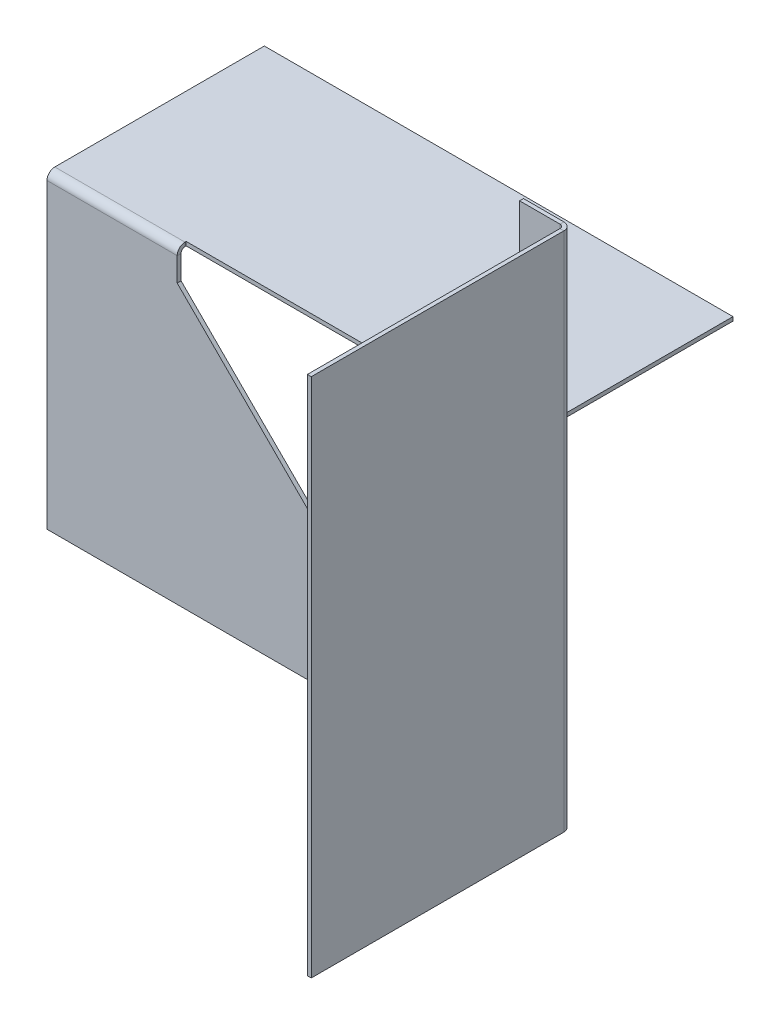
ISO-10303-21;
HEADER;
FILE_DESCRIPTION(('STEP AP214'),'2;1');
FILE_NAME('part.step','',(''),(''),'','','');
FILE_SCHEMA(('AUTOMOTIVE_DESIGN { 1 0 10303 214 1 1 1 1 }'));
ENDSEC;
DATA;
#1=APPLICATION_CONTEXT('core data for automotive mechanical design processes');
#2=APPLICATION_PROTOCOL_DEFINITION('international standard','automotive_design',2000,#1);
#3=PRODUCT_CONTEXT('',#1,'mechanical');
#4=PRODUCT('Part','Part','',(#3));
#5=PRODUCT_RELATED_PRODUCT_CATEGORY('part','',(#4));
#6=PRODUCT_DEFINITION_FORMATION('','',#4);
#7=PRODUCT_DEFINITION_CONTEXT('part definition',#1,'design');
#8=PRODUCT_DEFINITION('design','',#6,#7);
#9=PRODUCT_DEFINITION_SHAPE('','',#8);
#10=(LENGTH_UNIT() NAMED_UNIT(*) SI_UNIT(.MILLI.,.METRE.));
#11=(NAMED_UNIT(*) PLANE_ANGLE_UNIT() SI_UNIT($,.RADIAN.));
#12=(NAMED_UNIT(*) SI_UNIT($,.STERADIAN.) SOLID_ANGLE_UNIT());
#13=UNCERTAINTY_MEASURE_WITH_UNIT(LENGTH_MEASURE(1.E-05),#10,'distance_accuracy_value','');
#14=(GEOMETRIC_REPRESENTATION_CONTEXT(3) GLOBAL_UNCERTAINTY_ASSIGNED_CONTEXT((#13)) GLOBAL_UNIT_ASSIGNED_CONTEXT((#10,
#11,#12)) REPRESENTATION_CONTEXT('',''));
#15=CARTESIAN_POINT('',(0.,0.,0.));
#16=DIRECTION('',(0.,0.,1.));
#17=DIRECTION('',(1.,0.,0.));
#18=AXIS2_PLACEMENT_3D('',#15,#16,#17);
#19=CARTESIAN_POINT('',(-200.,200.,1.50000000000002));
#20=DIRECTION('',(-1.,0.,0.));
#21=DIRECTION('',(0.,0.,1.));
#22=AXIS2_PLACEMENT_3D('',#19,#20,#21);
#23=PLANE('',#22);
#24=DIRECTION('',(0.,-1.,0.));
#25=VECTOR('',#24,1.);
#26=CARTESIAN_POINT('',(-200.,200.,1.50000000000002));
#27=LINE('',#26,#25);
#28=CARTESIAN_POINT('',(-200.,116.,1.50000000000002));
#29=VERTEX_POINT('',#28);
#30=CARTESIAN_POINT('',(-200.,0.,1.50000000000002));
#31=VERTEX_POINT('',#30);
#32=EDGE_CURVE('E576',#29,#31,#27,.T.);
#33=ORIENTED_EDGE('',*,*,#32,.F.);
#34=DIRECTION('',(0.,0.,-1.));
#35=VECTOR('',#34,1.);
#36=CARTESIAN_POINT('',(-200.,116.,1.50000000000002));
#37=LINE('',#36,#35);
#38=CARTESIAN_POINT('',(-200.,116.,0.));
#39=VERTEX_POINT('',#38);
#40=EDGE_CURVE('E668',#29,#39,#37,.T.);
#41=ORIENTED_EDGE('',*,*,#40,.T.);
#42=DIRECTION('',(0.,-1.,0.));
#43=VECTOR('',#42,1.);
#44=CARTESIAN_POINT('',(-200.,200.,0.));
#45=LINE('',#44,#43);
#46=CARTESIAN_POINT('',(-200.,0.,0.));
#47=VERTEX_POINT('',#46);
#48=EDGE_CURVE('E581',#39,#47,#45,.T.);
#49=ORIENTED_EDGE('',*,*,#48,.T.);
#50=DIRECTION('',(0.,0.,-1.));
#51=VECTOR('',#50,1.);
#52=CARTESIAN_POINT('',(-200.,0.,1.50000000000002));
#53=LINE('',#52,#51);
#54=EDGE_CURVE('E546',#31,#47,#53,.T.);
#55=ORIENTED_EDGE('',*,*,#54,.F.);
#56=EDGE_LOOP('',(#33,#41,#49,#55));
#57=FACE_BOUND('',#56,.T.);
#58=ADVANCED_FACE('F45',(#57),#23,.T.);
#59=CARTESIAN_POINT('',(0.,200.,0.));
#60=DIRECTION('',(0.,0.,-1.));
#61=DIRECTION('',(-1.,0.,0.));
#62=AXIS2_PLACEMENT_3D('',#59,#60,#61);
#63=PLANE('',#62);
#64=ORIENTED_EDGE('',*,*,#48,.F.);
#65=DIRECTION('',(1.,0.,0.));
#66=VECTOR('',#65,1.);
#67=CARTESIAN_POINT('',(0.,116.,0.));
#68=LINE('',#67,#66);
#69=CARTESIAN_POINT('',(-150.,116.,4.05996130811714E-08));
#70=VERTEX_POINT('',#69);
#71=EDGE_CURVE('E601',#39,#70,#68,.T.);
#72=ORIENTED_EDGE('',*,*,#71,.T.);
#73=DIRECTION('',(0.,-1.,0.));
#74=VECTOR('',#73,1.);
#75=CARTESIAN_POINT('',(-150.,106.87867965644,0.));
#76=LINE('',#75,#74);
#77=CARTESIAN_POINT('',(-150.,106.87867965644,0.));
#78=VERTEX_POINT('',#77);
#79=EDGE_CURVE('E531',#70,#78,#76,.T.);
#80=ORIENTED_EDGE('',*,*,#79,.T.);
#81=DIRECTION('',(0.707106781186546,-0.707106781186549,0.));
#82=VECTOR('',#81,1.);
#83=CARTESIAN_POINT('',(-150.,106.87867965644,0.));
#84=LINE('',#83,#82);
#85=CARTESIAN_POINT('',(-70.,26.87867965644,0.));
#86=VERTEX_POINT('',#85);
#87=EDGE_CURVE('E512',#78,#86,#84,.T.);
#88=ORIENTED_EDGE('',*,*,#87,.T.);
#89=DIRECTION('',(0.,1.,0.));
#90=VECTOR('',#89,1.);
#91=CARTESIAN_POINT('',(-70.,28.9999999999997,0.));
#92=LINE('',#91,#90);
#93=CARTESIAN_POINT('',(-70.,28.9999999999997,0.));
#94=VERTEX_POINT('',#93);
#95=EDGE_CURVE('E515',#86,#94,#92,.T.);
#96=ORIENTED_EDGE('',*,*,#95,.T.);
#97=DIRECTION('',(-0.707106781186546,0.707106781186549,0.));
#98=VECTOR('',#97,1.);
#99=CARTESIAN_POINT('',(-148.5,107.5,0.));
#100=LINE('',#99,#98);
#101=CARTESIAN_POINT('',(-71.4657082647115,30.4657082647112,0.));
#102=VERTEX_POINT('',#101);
#103=EDGE_CURVE('E519',#94,#102,#100,.T.);
#104=ORIENTED_EDGE('',*,*,#103,.T.);
#105=DIRECTION('',(0.,1.,0.));
#106=VECTOR('',#105,1.);
#107=CARTESIAN_POINT('',(-71.4657082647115,200.,0.));
#108=LINE('',#107,#106);
#109=CARTESIAN_POINT('',(-71.4657082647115,115.,5.00255078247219E-08));
#110=VERTEX_POINT('',#109);
#111=EDGE_CURVE('E597',#102,#110,#108,.T.);
#112=ORIENTED_EDGE('',*,*,#111,.T.);
#113=DIRECTION('',(1.,0.,0.));
#114=VECTOR('',#113,1.);
#115=CARTESIAN_POINT('',(-76.,115.,0.));
#116=LINE('',#115,#114);
#117=CARTESIAN_POINT('',(-70.,115.,0.));
#118=VERTEX_POINT('',#117);
#119=EDGE_CURVE('E605',#110,#118,#116,.T.);
#120=ORIENTED_EDGE('',*,*,#119,.T.);
#121=DIRECTION('',(0.,1.,0.));
#122=VECTOR('',#121,1.);
#123=CARTESIAN_POINT('',(-70.,115.,0.));
#124=LINE('',#123,#122);
#125=CARTESIAN_POINT('',(-70.,116.,0.));
#126=VERTEX_POINT('',#125);
#127=EDGE_CURVE('E607',#118,#126,#124,.T.);
#128=ORIENTED_EDGE('',*,*,#127,.T.);
#129=DIRECTION('',(1.,0.,0.));
#130=VECTOR('',#129,1.);
#131=CARTESIAN_POINT('',(0.,116.,0.));
#132=LINE('',#131,#130);
#133=CARTESIAN_POINT('',(-20.,116.,4.05995972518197E-08));
#134=VERTEX_POINT('',#133);
#135=EDGE_CURVE('E701',#126,#134,#132,.T.);
#136=ORIENTED_EDGE('',*,*,#135,.T.);
#137=DIRECTION('',(0.,-1.,0.));
#138=VECTOR('',#137,1.);
#139=CARTESIAN_POINT('',(-20.,200.,0.));
#140=LINE('',#139,#138);
#141=CARTESIAN_POINT('',(-20.,115.5,0.));
#142=VERTEX_POINT('',#141);
#143=EDGE_CURVE('E494',#134,#142,#140,.T.);
#144=ORIENTED_EDGE('',*,*,#143,.T.);
#145=DIRECTION('',(1.,0.,0.));
#146=VECTOR('',#145,1.);
#147=CARTESIAN_POINT('',(-18.5,115.5,0.));
#148=LINE('',#147,#146);
#149=CARTESIAN_POINT('',(-18.5,115.5,0.));
#150=VERTEX_POINT('',#149);
#151=EDGE_CURVE('E495',#142,#150,#148,.T.);
#152=ORIENTED_EDGE('',*,*,#151,.T.);
#153=DIRECTION('',(0.,1.,0.));
#154=VECTOR('',#153,1.);
#155=CARTESIAN_POINT('',(-18.5,200.,0.));
#156=LINE('',#155,#154);
#157=CARTESIAN_POINT('',(-18.5,200.,0.));
#158=VERTEX_POINT('',#157);
#159=EDGE_CURVE('E491',#150,#158,#156,.T.);
#160=ORIENTED_EDGE('',*,*,#159,.T.);
#161=DIRECTION('',(1.,0.,0.));
#162=VECTOR('',#161,1.);
#163=CARTESIAN_POINT('',(0.,200.,0.));
#164=LINE('',#163,#162);
#165=CARTESIAN_POINT('',(-3.,200.,0.));
#166=VERTEX_POINT('',#165);
#167=EDGE_CURVE('E566',#158,#166,#164,.T.);
#168=ORIENTED_EDGE('',*,*,#167,.T.);
#169=DIRECTION('',(0.,-1.,0.));
#170=VECTOR('',#169,1.);
#171=CARTESIAN_POINT('',(-3.,200.,0.));
#172=LINE('',#171,#170);
#173=CARTESIAN_POINT('',(-3.,0.,0.));
#174=VERTEX_POINT('',#173);
#175=EDGE_CURVE('E577',#166,#174,#172,.T.);
#176=ORIENTED_EDGE('',*,*,#175,.T.);
#177=DIRECTION('',(1.,0.,0.));
#178=VECTOR('',#177,1.);
#179=CARTESIAN_POINT('',(0.,0.,0.));
#180=LINE('',#179,#178);
#181=EDGE_CURVE('E543',#47,#174,#180,.T.);
#182=ORIENTED_EDGE('',*,*,#181,.F.);
#183=EDGE_LOOP('',(#64,#72,#80,#88,#96,#104,#112,#120,#128,#136,#144,#152,#160,#168,#176,#182));
#184=FACE_BOUND('',#183,.T.);
#185=ADVANCED_FACE('F644',(#184),#63,.T.);
#186=CARTESIAN_POINT('',(-3.,200.,3.));
#187=DIRECTION('',(0.,1.,0.));
#188=DIRECTION('',(0.,0.,1.));
#189=AXIS2_PLACEMENT_3D('',#186,#187,#188);
#190=PLANE('',#189);
#191=DIRECTION('',(0.,0.,1.));
#192=VECTOR('',#191,1.);
#193=CARTESIAN_POINT('',(-18.5,200.,0.));
#194=LINE('',#193,#192);
#195=CARTESIAN_POINT('',(-18.5,200.,1.5));
#196=VERTEX_POINT('',#195);
#197=EDGE_CURVE('E498',#158,#196,#194,.T.);
#198=ORIENTED_EDGE('',*,*,#197,.T.);
#199=DIRECTION('',(1.,0.,0.));
#200=VECTOR('',#199,1.);
#201=CARTESIAN_POINT('',(0.,200.,1.5));
#202=LINE('',#201,#200);
#203=CARTESIAN_POINT('',(-3.,200.,1.5));
#204=VERTEX_POINT('',#203);
#205=EDGE_CURVE('E49',#196,#204,#202,.T.);
#206=ORIENTED_EDGE('',*,*,#205,.T.);
#207=DIRECTION('',(0.,0.,-1.));
#208=VECTOR('',#207,1.);
#209=CARTESIAN_POINT('',(-3.,200.,1.5));
#210=LINE('',#209,#208);
#211=EDGE_CURVE('E592',#204,#166,#210,.T.);
#212=ORIENTED_EDGE('',*,*,#211,.T.);
#213=ORIENTED_EDGE('',*,*,#167,.F.);
#214=EDGE_LOOP('',(#198,#206,#212,#213));
#215=FACE_BOUND('',#214,.T.);
#216=ADVANCED_FACE('F641',(#215),#190,.T.);
#217=CARTESIAN_POINT('',(0.,200.,3.));
#218=DIRECTION('',(0.,1.,0.));
#219=DIRECTION('',(0.,0.,1.));
#220=AXIS2_PLACEMENT_3D('',#217,#218,#219);
#221=PLANE('',#220);
#222=DIRECTION('',(-1.,0.,0.));
#223=VECTOR('',#222,1.);
#224=CARTESIAN_POINT('',(0.,200.,3.));
#225=LINE('',#224,#223);
#226=CARTESIAN_POINT('',(0.,200.,3.));
#227=VERTEX_POINT('',#226);
#228=CARTESIAN_POINT('',(-1.5,200.,3.));
#229=VERTEX_POINT('',#228);
#230=EDGE_CURVE('E595',#227,#229,#225,.T.);
#231=ORIENTED_EDGE('',*,*,#230,.F.);
#232=CARTESIAN_POINT('',(-3.,200.,3.));
#233=DIRECTION('',(0.,1.,0.));
#234=DIRECTION('',(0.,0.,1.));
#235=AXIS2_PLACEMENT_3D('',#232,#233,#234);
#236=CIRCLE('',#235,3.);
#237=EDGE_CURVE('E563',#166,#227,#236,.F.);
#238=ORIENTED_EDGE('',*,*,#237,.F.);
#239=ORIENTED_EDGE('',*,*,#211,.F.);
#240=CARTESIAN_POINT('',(-3.,200.,3.));
#241=DIRECTION('',(0.,1.,0.));
#242=DIRECTION('',(1.,0.,0.));
#243=AXIS2_PLACEMENT_3D('',#240,#241,#242);
#244=CIRCLE('',#243,1.5);
#245=EDGE_CURVE('E567',#204,#229,#244,.F.);
#246=ORIENTED_EDGE('',*,*,#245,.T.);
#247=EDGE_LOOP('',(#231,#238,#239,#246));
#248=FACE_BOUND('',#247,.T.);
#249=ADVANCED_FACE('F635',(#248),#221,.T.);
#250=CARTESIAN_POINT('',(-3.,200.,1.5));
#251=DIRECTION('',(0.,1.,0.));
#252=DIRECTION('',(0.,0.,1.));
#253=AXIS2_PLACEMENT_3D('',#250,#251,#252);
#254=PLANE('',#253);
#255=DIRECTION('',(0.,0.,1.));
#256=VECTOR('',#255,1.);
#257=CARTESIAN_POINT('',(0.,200.,0.));
#258=LINE('',#257,#256);
#259=CARTESIAN_POINT('',(0.,200.,100.));
#260=VERTEX_POINT('',#259);
#261=EDGE_CURVE('E560',#227,#260,#258,.T.);
#262=ORIENTED_EDGE('',*,*,#261,.F.);
#263=ORIENTED_EDGE('',*,*,#230,.T.);
#264=DIRECTION('',(0.,0.,1.));
#265=VECTOR('',#264,1.);
#266=CARTESIAN_POINT('',(-1.5,200.,0.));
#267=LINE('',#266,#265);
#268=CARTESIAN_POINT('',(-1.49999999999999,200.,100.));
#269=VERTEX_POINT('',#268);
#270=EDGE_CURVE('E555',#229,#269,#267,.T.);
#271=ORIENTED_EDGE('',*,*,#270,.T.);
#272=DIRECTION('',(-1.,0.,0.));
#273=VECTOR('',#272,1.);
#274=CARTESIAN_POINT('',(0.,200.,100.));
#275=LINE('',#274,#273);
#276=EDGE_CURVE('E557',#260,#269,#275,.T.);
#277=ORIENTED_EDGE('',*,*,#276,.F.);
#278=EDGE_LOOP('',(#262,#263,#271,#277));
#279=FACE_BOUND('',#278,.T.);
#280=ADVANCED_FACE('F735',(#279),#254,.T.);
#281=CARTESIAN_POINT('',(-3.,0.,0.));
#282=DIRECTION('',(0.,-1.,0.));
#283=DIRECTION('',(0.,0.,-1.));
#284=AXIS2_PLACEMENT_3D('',#281,#282,#283);
#285=PLANE('',#284);
#286=DIRECTION('',(0.,0.,1.));
#287=VECTOR('',#286,1.);
#288=CARTESIAN_POINT('',(-3.,0.,0.));
#289=LINE('',#288,#287);
#290=CARTESIAN_POINT('',(-3.,0.,1.5));
#291=VERTEX_POINT('',#290);
#292=EDGE_CURVE('E590',#174,#291,#289,.T.);
#293=ORIENTED_EDGE('',*,*,#292,.F.);
#294=CARTESIAN_POINT('',(-3.,0.,3.));
#295=DIRECTION('',(0.,1.,0.));
#296=DIRECTION('',(0.,0.,1.));
#297=AXIS2_PLACEMENT_3D('',#294,#295,#296);
#298=CIRCLE('',#297,3.);
#299=CARTESIAN_POINT('',(0.,0.,3.));
#300=VERTEX_POINT('',#299);
#301=EDGE_CURVE('E540',#174,#300,#298,.F.);
#302=ORIENTED_EDGE('',*,*,#301,.T.);
#303=DIRECTION('',(1.,0.,0.));
#304=VECTOR('',#303,1.);
#305=CARTESIAN_POINT('',(-1.5,0.,3.));
#306=LINE('',#305,#304);
#307=CARTESIAN_POINT('',(-1.5,0.,3.));
#308=VERTEX_POINT('',#307);
#309=EDGE_CURVE('E588',#308,#300,#306,.T.);
#310=ORIENTED_EDGE('',*,*,#309,.F.);
#311=CARTESIAN_POINT('',(-3.,0.,3.));
#312=DIRECTION('',(0.,1.,0.));
#313=DIRECTION('',(1.,0.,0.));
#314=AXIS2_PLACEMENT_3D('',#311,#312,#313);
#315=CIRCLE('',#314,1.5);
#316=EDGE_CURVE('E552',#291,#308,#315,.F.);
#317=ORIENTED_EDGE('',*,*,#316,.F.);
#318=EDGE_LOOP('',(#293,#302,#310,#317));
#319=FACE_BOUND('',#318,.T.);
#320=ADVANCED_FACE('F746',(#319),#285,.T.);
#321=CARTESIAN_POINT('',(-1.5,0.,3.));
#322=DIRECTION('',(0.,-1.,0.));
#323=DIRECTION('',(0.,0.,-1.));
#324=AXIS2_PLACEMENT_3D('',#321,#322,#323);
#325=PLANE('',#324);
#326=ORIENTED_EDGE('',*,*,#181,.T.);
#327=ORIENTED_EDGE('',*,*,#292,.T.);
#328=DIRECTION('',(1.,0.,0.));
#329=VECTOR('',#328,1.);
#330=CARTESIAN_POINT('',(0.,0.,1.5));
#331=LINE('',#330,#329);
#332=EDGE_CURVE('E549',#31,#291,#331,.T.);
#333=ORIENTED_EDGE('',*,*,#332,.F.);
#334=ORIENTED_EDGE('',*,*,#54,.T.);
#335=EDGE_LOOP('',(#326,#327,#333,#334));
#336=FACE_BOUND('',#335,.T.);
#337=ADVANCED_FACE('F744',(#336),#325,.T.);
#338=CARTESIAN_POINT('',(-1.5,200.,0.));
#339=DIRECTION('',(1.,0.,0.));
#340=DIRECTION('',(0.,0.,-1.));
#341=AXIS2_PLACEMENT_3D('',#338,#339,#340);
#342=PLANE('',#341);
#343=DIRECTION('',(0.,0.,1.));
#344=VECTOR('',#343,1.);
#345=CARTESIAN_POINT('',(-1.5,0.,0.));
#346=LINE('',#345,#344);
#347=CARTESIAN_POINT('',(-1.49999999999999,0.,100.));
#348=VERTEX_POINT('',#347);
#349=EDGE_CURVE('E523',#308,#348,#346,.T.);
#350=ORIENTED_EDGE('',*,*,#349,.T.);
#351=DIRECTION('',(0.,-1.,0.));
#352=VECTOR('',#351,1.);
#353=CARTESIAN_POINT('',(-1.49999999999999,200.,100.));
#354=LINE('',#353,#352);
#355=EDGE_CURVE('E586',#269,#348,#354,.T.);
#356=ORIENTED_EDGE('',*,*,#355,.F.);
#357=ORIENTED_EDGE('',*,*,#270,.F.);
#358=DIRECTION('',(0.,-1.,0.));
#359=VECTOR('',#358,1.);
#360=CARTESIAN_POINT('',(-1.5,200.,3.));
#361=LINE('',#360,#359);
#362=EDGE_CURVE('E570',#229,#308,#361,.T.);
#363=ORIENTED_EDGE('',*,*,#362,.T.);
#364=EDGE_LOOP('',(#350,#356,#357,#363));
#365=FACE_BOUND('',#364,.T.);
#366=ADVANCED_FACE('F731',(#365),#342,.F.);
#367=CARTESIAN_POINT('',(0.,200.,100.));
#368=DIRECTION('',(0.,0.,1.));
#369=DIRECTION('',(1.,0.,0.));
#370=AXIS2_PLACEMENT_3D('',#367,#368,#369);
#371=PLANE('',#370);
#372=DIRECTION('',(-1.,0.,0.));
#373=VECTOR('',#372,1.);
#374=CARTESIAN_POINT('',(0.,0.,100.));
#375=LINE('',#374,#373);
#376=CARTESIAN_POINT('',(0.,0.,100.));
#377=VERTEX_POINT('',#376);
#378=EDGE_CURVE('E534',#377,#348,#375,.T.);
#379=ORIENTED_EDGE('',*,*,#378,.F.);
#380=DIRECTION('',(0.,-1.,0.));
#381=VECTOR('',#380,1.);
#382=CARTESIAN_POINT('',(0.,200.,100.));
#383=LINE('',#382,#381);
#384=EDGE_CURVE('E584',#260,#377,#383,.T.);
#385=ORIENTED_EDGE('',*,*,#384,.F.);
#386=ORIENTED_EDGE('',*,*,#276,.T.);
#387=ORIENTED_EDGE('',*,*,#355,.T.);
#388=EDGE_LOOP('',(#379,#385,#386,#387));
#389=FACE_BOUND('',#388,.T.);
#390=ADVANCED_FACE('F751',(#389),#371,.T.);
#391=CARTESIAN_POINT('',(0.,200.,0.));
#392=DIRECTION('',(1.,0.,0.));
#393=DIRECTION('',(0.,0.,-1.));
#394=AXIS2_PLACEMENT_3D('',#391,#392,#393);
#395=PLANE('',#394);
#396=DIRECTION('',(0.,0.,1.));
#397=VECTOR('',#396,1.);
#398=CARTESIAN_POINT('',(0.,0.,0.));
#399=LINE('',#398,#397);
#400=EDGE_CURVE('E537',#300,#377,#399,.T.);
#401=ORIENTED_EDGE('',*,*,#400,.F.);
#402=DIRECTION('',(0.,-1.,0.));
#403=VECTOR('',#402,1.);
#404=CARTESIAN_POINT('',(0.,200.,3.));
#405=LINE('',#404,#403);
#406=EDGE_CURVE('E580',#227,#300,#405,.T.);
#407=ORIENTED_EDGE('',*,*,#406,.F.);
#408=ORIENTED_EDGE('',*,*,#261,.T.);
#409=ORIENTED_EDGE('',*,*,#384,.T.);
#410=EDGE_LOOP('',(#401,#407,#408,#409));
#411=FACE_BOUND('',#410,.T.);
#412=ADVANCED_FACE('F739',(#411),#395,.T.);
#413=CARTESIAN_POINT('',(-3.,200.,3.));
#414=DIRECTION('',(0.,-1.,0.));
#415=DIRECTION('',(0.,0.,-1.));
#416=AXIS2_PLACEMENT_3D('',#413,#414,#415);
#417=CYLINDRICAL_SURFACE('',#416,3.);
#418=ORIENTED_EDGE('',*,*,#301,.F.);
#419=ORIENTED_EDGE('',*,*,#175,.F.);
#420=ORIENTED_EDGE('',*,*,#237,.T.);
#421=ORIENTED_EDGE('',*,*,#406,.T.);
#422=EDGE_LOOP('',(#418,#419,#420,#421));
#423=FACE_BOUND('',#422,.T.);
#424=ADVANCED_FACE('F655',(#423),#417,.T.);
#425=CARTESIAN_POINT('',(0.,200.,1.5));
#426=DIRECTION('',(0.,0.,-1.));
#427=DIRECTION('',(-1.,0.,0.));
#428=AXIS2_PLACEMENT_3D('',#425,#426,#427);
#429=PLANE('',#428);
#430=DIRECTION('',(1.,0.,0.));
#431=VECTOR('',#430,1.);
#432=CARTESIAN_POINT('',(0.,116.,1.5));
#433=LINE('',#432,#431);
#434=CARTESIAN_POINT('',(-150.,116.,1.5));
#435=VERTEX_POINT('',#434);
#436=EDGE_CURVE('E673',#29,#435,#433,.T.);
#437=ORIENTED_EDGE('',*,*,#436,.F.);
#438=ORIENTED_EDGE('',*,*,#32,.T.);
#439=ORIENTED_EDGE('',*,*,#332,.T.);
#440=DIRECTION('',(0.,-1.,0.));
#441=VECTOR('',#440,1.);
#442=CARTESIAN_POINT('',(-3.,200.,1.5));
#443=LINE('',#442,#441);
#444=EDGE_CURVE('E573',#204,#291,#443,.T.);
#445=ORIENTED_EDGE('',*,*,#444,.F.);
#446=ORIENTED_EDGE('',*,*,#205,.F.);
#447=DIRECTION('',(0.,1.,0.));
#448=VECTOR('',#447,1.);
#449=CARTESIAN_POINT('',(-18.5,200.,1.5));
#450=LINE('',#449,#448);
#451=CARTESIAN_POINT('',(-18.5,115.5,1.5));
#452=VERTEX_POINT('',#451);
#453=EDGE_CURVE('E414',#452,#196,#450,.T.);
#454=ORIENTED_EDGE('',*,*,#453,.F.);
#455=DIRECTION('',(1.,0.,0.));
#456=VECTOR('',#455,1.);
#457=CARTESIAN_POINT('',(-18.5,115.5,1.5));
#458=LINE('',#457,#456);
#459=CARTESIAN_POINT('',(-20.,115.5,1.5));
#460=VERTEX_POINT('',#459);
#461=EDGE_CURVE('E488',#460,#452,#458,.T.);
#462=ORIENTED_EDGE('',*,*,#461,.F.);
#463=DIRECTION('',(0.,-1.,0.));
#464=VECTOR('',#463,1.);
#465=CARTESIAN_POINT('',(-20.,200.,1.5));
#466=LINE('',#465,#464);
#467=CARTESIAN_POINT('',(-20.,116.,1.5));
#468=VERTEX_POINT('',#467);
#469=EDGE_CURVE('E62',#468,#460,#466,.T.);
#470=ORIENTED_EDGE('',*,*,#469,.F.);
#471=DIRECTION('',(1.,0.,0.));
#472=VECTOR('',#471,1.);
#473=CARTESIAN_POINT('',(0.,116.,1.5));
#474=LINE('',#473,#472);
#475=CARTESIAN_POINT('',(-70.,116.,1.5));
#476=VERTEX_POINT('',#475);
#477=EDGE_CURVE('E54',#476,#468,#474,.T.);
#478=ORIENTED_EDGE('',*,*,#477,.F.);
#479=DIRECTION('',(0.,1.,0.));
#480=VECTOR('',#479,1.);
#481=CARTESIAN_POINT('',(-70.,115.,1.5));
#482=LINE('',#481,#480);
#483=CARTESIAN_POINT('',(-70.,115.,1.5));
#484=VERTEX_POINT('',#483);
#485=EDGE_CURVE('E70',#484,#476,#482,.T.);
#486=ORIENTED_EDGE('',*,*,#485,.F.);
#487=DIRECTION('',(1.,0.,0.));
#488=VECTOR('',#487,1.);
#489=CARTESIAN_POINT('',(-76.,115.,1.5));
#490=LINE('',#489,#488);
#491=CARTESIAN_POINT('',(-71.4657082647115,115.,1.5));
#492=VERTEX_POINT('',#491);
#493=EDGE_CURVE('E603',#492,#484,#490,.T.);
#494=ORIENTED_EDGE('',*,*,#493,.F.);
#495=DIRECTION('',(0.,1.,0.));
#496=VECTOR('',#495,1.);
#497=CARTESIAN_POINT('',(-71.4657082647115,200.,1.50000000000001));
#498=LINE('',#497,#496);
#499=CARTESIAN_POINT('',(-71.4657082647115,30.4657082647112,1.5));
#500=VERTEX_POINT('',#499);
#501=EDGE_CURVE('E602',#500,#492,#498,.T.);
#502=ORIENTED_EDGE('',*,*,#501,.F.);
#503=DIRECTION('',(-0.707106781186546,0.707106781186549,0.));
#504=VECTOR('',#503,1.);
#505=CARTESIAN_POINT('',(-148.5,107.5,1.5));
#506=LINE('',#505,#504);
#507=CARTESIAN_POINT('',(-70.,28.9999999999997,1.5));
#508=VERTEX_POINT('',#507);
#509=EDGE_CURVE('E511',#508,#500,#506,.T.);
#510=ORIENTED_EDGE('',*,*,#509,.F.);
#511=DIRECTION('',(0.,1.,0.));
#512=VECTOR('',#511,1.);
#513=CARTESIAN_POINT('',(-70.,28.9999999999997,1.5));
#514=LINE('',#513,#512);
#515=CARTESIAN_POINT('',(-70.,26.87867965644,1.50000000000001));
#516=VERTEX_POINT('',#515);
#517=EDGE_CURVE('E508',#516,#508,#514,.T.);
#518=ORIENTED_EDGE('',*,*,#517,.F.);
#519=DIRECTION('',(0.707106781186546,-0.707106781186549,0.));
#520=VECTOR('',#519,1.);
#521=CARTESIAN_POINT('',(-150.,106.87867965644,1.5));
#522=LINE('',#521,#520);
#523=CARTESIAN_POINT('',(-150.,106.87867965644,1.5));
#524=VERTEX_POINT('',#523);
#525=EDGE_CURVE('E501',#524,#516,#522,.T.);
#526=ORIENTED_EDGE('',*,*,#525,.F.);
#527=DIRECTION('',(0.,-1.,0.));
#528=VECTOR('',#527,1.);
#529=CARTESIAN_POINT('',(-150.,106.87867965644,1.5));
#530=LINE('',#529,#528);
#531=EDGE_CURVE('E516',#435,#524,#530,.T.);
#532=ORIENTED_EDGE('',*,*,#531,.F.);
#533=EDGE_LOOP('',(#437,#438,#439,#445,#446,#454,#462,#470,#478,#486,#494,#502,#510,#518,#526,#532));
#534=FACE_BOUND('',#533,.T.);
#535=ADVANCED_FACE('F651',(#534),#429,.F.);
#536=CARTESIAN_POINT('',(-3.,200.,3.));
#537=DIRECTION('',(0.,-1.,0.));
#538=DIRECTION('',(0.,0.,-1.));
#539=AXIS2_PLACEMENT_3D('',#536,#537,#538);
#540=CYLINDRICAL_SURFACE('',#539,1.5);
#541=ORIENTED_EDGE('',*,*,#316,.T.);
#542=ORIENTED_EDGE('',*,*,#362,.F.);
#543=ORIENTED_EDGE('',*,*,#245,.F.);
#544=ORIENTED_EDGE('',*,*,#444,.T.);
#545=EDGE_LOOP('',(#541,#542,#543,#544));
#546=FACE_BOUND('',#545,.T.);
#547=ADVANCED_FACE('F654',(#546),#540,.F.);
#548=CARTESIAN_POINT('',(-3.,0.,3.));
#549=DIRECTION('',(0.,1.,0.));
#550=DIRECTION('',(0.,0.,1.));
#551=AXIS2_PLACEMENT_3D('',#548,#549,#550);
#552=PLANE('',#551);
#553=ORIENTED_EDGE('',*,*,#349,.F.);
#554=ORIENTED_EDGE('',*,*,#309,.T.);
#555=ORIENTED_EDGE('',*,*,#400,.T.);
#556=ORIENTED_EDGE('',*,*,#378,.T.);
#557=EDGE_LOOP('',(#553,#554,#555,#556));
#558=FACE_BOUND('',#557,.T.);
#559=ADVANCED_FACE('F748',(#558),#552,.F.);
#560=CARTESIAN_POINT('',(-150.,106.87867965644,0.));
#561=DIRECTION('',(-0.707106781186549,-0.707106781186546,0.));
#562=DIRECTION('',(0.707106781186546,-0.707106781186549,0.));
#563=AXIS2_PLACEMENT_3D('',#560,#561,#562);
#564=PLANE('',#563);
#565=ORIENTED_EDGE('',*,*,#525,.T.);
#566=DIRECTION('',(0.,0.,1.));
#567=VECTOR('',#566,1.);
#568=CARTESIAN_POINT('',(-70.,26.87867965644,0.));
#569=LINE('',#568,#567);
#570=EDGE_CURVE('E528',#86,#516,#569,.T.);
#571=ORIENTED_EDGE('',*,*,#570,.F.);
#572=ORIENTED_EDGE('',*,*,#87,.F.);
#573=DIRECTION('',(0.,0.,1.));
#574=VECTOR('',#573,1.);
#575=CARTESIAN_POINT('',(-150.,106.87867965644,0.));
#576=LINE('',#575,#574);
#577=EDGE_CURVE('E520',#78,#524,#576,.T.);
#578=ORIENTED_EDGE('',*,*,#577,.T.);
#579=EDGE_LOOP('',(#565,#571,#572,#578));
#580=FACE_BOUND('',#579,.T.);
#581=ADVANCED_FACE('F830',(#580),#564,.F.);
#582=CARTESIAN_POINT('',(-150.,106.87867965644,0.));
#583=DIRECTION('',(-1.,0.,0.));
#584=DIRECTION('',(0.,0.,1.));
#585=AXIS2_PLACEMENT_3D('',#582,#583,#584);
#586=PLANE('',#585);
#587=DIRECTION('',(0.,0.,-1.));
#588=VECTOR('',#587,1.);
#589=CARTESIAN_POINT('',(-150.,116.,0.));
#590=LINE('',#589,#588);
#591=EDGE_CURVE('E679',#435,#70,#590,.T.);
#592=ORIENTED_EDGE('',*,*,#591,.F.);
#593=ORIENTED_EDGE('',*,*,#531,.T.);
#594=ORIENTED_EDGE('',*,*,#577,.F.);
#595=ORIENTED_EDGE('',*,*,#79,.F.);
#596=EDGE_LOOP('',(#592,#593,#594,#595));
#597=FACE_BOUND('',#596,.T.);
#598=ADVANCED_FACE('F47',(#597),#586,.F.);
#599=CARTESIAN_POINT('',(-70.,115.,0.));
#600=DIRECTION('',(1.,0.,0.));
#601=DIRECTION('',(0.,0.,-1.));
#602=AXIS2_PLACEMENT_3D('',#599,#600,#601);
#603=PLANE('',#602);
#604=DIRECTION('',(0.,0.,1.));
#605=VECTOR('',#604,1.);
#606=CARTESIAN_POINT('',(-70.,116.,0.));
#607=LINE('',#606,#605);
#608=EDGE_CURVE('E704',#126,#476,#607,.T.);
#609=ORIENTED_EDGE('',*,*,#608,.F.);
#610=ORIENTED_EDGE('',*,*,#127,.F.);
#611=DIRECTION('',(0.,0.,1.));
#612=VECTOR('',#611,1.);
#613=CARTESIAN_POINT('',(-70.,115.,0.));
#614=LINE('',#613,#612);
#615=EDGE_CURVE('E524',#118,#484,#614,.T.);
#616=ORIENTED_EDGE('',*,*,#615,.T.);
#617=ORIENTED_EDGE('',*,*,#485,.T.);
#618=EDGE_LOOP('',(#609,#610,#616,#617));
#619=FACE_BOUND('',#618,.T.);
#620=ADVANCED_FACE('F639',(#619),#603,.F.);
#621=CARTESIAN_POINT('',(-76.,115.,0.));
#622=DIRECTION('',(0.,-1.,0.));
#623=DIRECTION('',(0.,0.,-1.));
#624=AXIS2_PLACEMENT_3D('',#621,#622,#623);
#625=PLANE('',#624);
#626=DIRECTION('',(0.,0.,-1.));
#627=VECTOR('',#626,1.);
#628=CARTESIAN_POINT('',(-71.4657082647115,115.,0.));
#629=LINE('',#628,#627);
#630=EDGE_CURVE('E598',#492,#110,#629,.T.);
#631=ORIENTED_EDGE('',*,*,#630,.F.);
#632=ORIENTED_EDGE('',*,*,#493,.T.);
#633=ORIENTED_EDGE('',*,*,#615,.F.);
#634=ORIENTED_EDGE('',*,*,#119,.F.);
#635=EDGE_LOOP('',(#631,#632,#633,#634));
#636=FACE_BOUND('',#635,.T.);
#637=ADVANCED_FACE('F634',(#636),#625,.F.);
#638=CARTESIAN_POINT('',(-148.5,107.5,0.));
#639=DIRECTION('',(0.707106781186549,0.707106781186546,0.));
#640=DIRECTION('',(-0.707106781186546,0.707106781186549,0.));
#641=AXIS2_PLACEMENT_3D('',#638,#639,#640);
#642=PLANE('',#641);
#643=CARTESIAN_POINT('',(-71.4657082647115,30.4657082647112,5.00255073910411E-08));
#644=CARTESIAN_POINT('',(-71.4657082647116,30.4657082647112,1.50000005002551));
#645=B_SPLINE_CURVE_WITH_KNOTS('',1,(#643,#644),.UNSPECIFIED.,.F.,.F.,(2,2),(0.,1.),.UNSPECIFIED.);
#646=EDGE_CURVE('E477',#102,#500,#645,.T.);
#647=ORIENTED_EDGE('',*,*,#646,.F.);
#648=ORIENTED_EDGE('',*,*,#103,.F.);
#649=DIRECTION('',(0.,0.,1.));
#650=VECTOR('',#649,1.);
#651=CARTESIAN_POINT('',(-70.,28.9999999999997,0.));
#652=LINE('',#651,#650);
#653=EDGE_CURVE('E526',#94,#508,#652,.T.);
#654=ORIENTED_EDGE('',*,*,#653,.T.);
#655=ORIENTED_EDGE('',*,*,#509,.T.);
#656=EDGE_LOOP('',(#647,#648,#654,#655));
#657=FACE_BOUND('',#656,.T.);
#658=ADVANCED_FACE('F623',(#657),#642,.F.);
#659=CARTESIAN_POINT('',(-70.,28.9999999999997,0.));
#660=DIRECTION('',(1.,0.,0.));
#661=DIRECTION('',(0.,0.,-1.));
#662=AXIS2_PLACEMENT_3D('',#659,#660,#661);
#663=PLANE('',#662);
#664=ORIENTED_EDGE('',*,*,#517,.T.);
#665=ORIENTED_EDGE('',*,*,#653,.F.);
#666=ORIENTED_EDGE('',*,*,#95,.F.);
#667=ORIENTED_EDGE('',*,*,#570,.T.);
#668=EDGE_LOOP('',(#664,#665,#666,#667));
#669=FACE_BOUND('',#668,.T.);
#670=ADVANCED_FACE('F633',(#669),#663,.F.);
#671=CARTESIAN_POINT('',(-18.5,200.,0.));
#672=DIRECTION('',(1.,0.,0.));
#673=DIRECTION('',(0.,0.,-1.));
#674=AXIS2_PLACEMENT_3D('',#671,#672,#673);
#675=PLANE('',#674);
#676=ORIENTED_EDGE('',*,*,#453,.T.);
#677=ORIENTED_EDGE('',*,*,#197,.F.);
#678=ORIENTED_EDGE('',*,*,#159,.F.);
#679=DIRECTION('',(0.,0.,1.));
#680=VECTOR('',#679,1.);
#681=CARTESIAN_POINT('',(-18.5,115.5,0.));
#682=LINE('',#681,#680);
#683=EDGE_CURVE('E499',#150,#452,#682,.T.);
#684=ORIENTED_EDGE('',*,*,#683,.T.);
#685=EDGE_LOOP('',(#676,#677,#678,#684));
#686=FACE_BOUND('',#685,.T.);
#687=ADVANCED_FACE('F879',(#686),#675,.F.);
#688=CARTESIAN_POINT('',(-18.5,115.5,0.));
#689=DIRECTION('',(0.,-1.,0.));
#690=DIRECTION('',(0.,0.,-1.));
#691=AXIS2_PLACEMENT_3D('',#688,#689,#690);
#692=PLANE('',#691);
#693=ORIENTED_EDGE('',*,*,#461,.T.);
#694=ORIENTED_EDGE('',*,*,#683,.F.);
#695=ORIENTED_EDGE('',*,*,#151,.F.);
#696=DIRECTION('',(0.,0.,1.));
#697=VECTOR('',#696,1.);
#698=CARTESIAN_POINT('',(-20.,115.5,0.));
#699=LINE('',#698,#697);
#700=EDGE_CURVE('E502',#142,#460,#699,.T.);
#701=ORIENTED_EDGE('',*,*,#700,.T.);
#702=EDGE_LOOP('',(#693,#694,#695,#701));
#703=FACE_BOUND('',#702,.T.);
#704=ADVANCED_FACE('F657',(#703),#692,.F.);
#705=CARTESIAN_POINT('',(-20.,200.,0.));
#706=DIRECTION('',(-1.,0.,0.));
#707=DIRECTION('',(0.,-1.,0.));
#708=AXIS2_PLACEMENT_3D('',#705,#706,#707);
#709=PLANE('',#708);
#710=DIRECTION('',(0.,0.,-1.));
#711=VECTOR('',#710,1.);
#712=CARTESIAN_POINT('',(-20.,116.,0.));
#713=LINE('',#712,#711);
#714=EDGE_CURVE('E12',#468,#134,#713,.T.);
#715=ORIENTED_EDGE('',*,*,#714,.F.);
#716=ORIENTED_EDGE('',*,*,#469,.T.);
#717=ORIENTED_EDGE('',*,*,#700,.F.);
#718=ORIENTED_EDGE('',*,*,#143,.F.);
#719=EDGE_LOOP('',(#715,#716,#717,#718));
#720=FACE_BOUND('',#719,.T.);
#721=ADVANCED_FACE('F442',(#720),#709,.F.);
#722=CARTESIAN_POINT('',(-71.4657082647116,30.4657082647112,1.50000005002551));
#723=CARTESIAN_POINT('',(-71.8584526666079,30.7602665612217,1.5000000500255));
#724=CARTESIAN_POINT('',(-72.2509519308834,31.0547568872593,1.42191807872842));
#725=CARTESIAN_POINT('',(-72.976565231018,31.6438055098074,1.12135920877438));
#726=CARTESIAN_POINT('',(-73.3093484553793,31.9383298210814,0.899000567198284));
#727=CARTESIAN_POINT('',(-73.8647088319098,32.5273784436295,0.343640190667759));
#728=CARTESIAN_POINT('',(-74.0870674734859,32.8219027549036,0.010856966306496));
#729=CARTESIAN_POINT('',(-74.3876263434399,33.4109513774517,-0.714756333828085));
#730=CARTESIAN_POINT('',(-74.465708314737,33.7054417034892,-1.10725559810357));
#731=CARTESIAN_POINT('',(-74.465708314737,33.9999999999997,-1.49999999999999));
#732=CARTESIAN_POINT('',(-71.4657082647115,30.4657082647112,5.00255073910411E-08));
#733=CARTESIAN_POINT('',(-71.6620687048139,30.7602489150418,5.00255064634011E-08));
#734=CARTESIAN_POINT('',(-71.8583301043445,31.0547568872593,-0.0390409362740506));
#735=CARTESIAN_POINT('',(-72.2211367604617,31.6438055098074,-0.189320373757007));
#736=CARTESIAN_POINT('',(-72.3875283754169,31.9383298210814,-0.300499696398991));
#737=CARTESIAN_POINT('',(-72.6652085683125,32.5273784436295,-0.578179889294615));
#738=CARTESIAN_POINT('',(-72.7763878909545,32.8219027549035,-0.744571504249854));
#739=CARTESIAN_POINT('',(-72.9266673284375,33.4109513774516,-1.107378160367));
#740=CARTESIAN_POINT('',(-72.965708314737,33.7054593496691,-1.30363955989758));
#741=CARTESIAN_POINT('',(-72.965708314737,33.9999999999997,-1.49999999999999));
#742=B_SPLINE_SURFACE_WITH_KNOTS('',1,3,((#722,#723,#724,#725,#726,#727,#728,#729,#730,#731),
(#732,#733,#734,#735,#736,#737,#738,#739,#740,#741)),.UNSPECIFIED.,.F.,.F.,.F.,(2,2),(4,2,2,2,
4),(0.,1.),(0.,0.25,0.5,0.75,1.),.UNSPECIFIED.);
#743=CARTESIAN_POINT('',(-71.4657082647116,30.4657082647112,1.50000005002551));
#744=CARTESIAN_POINT('',(-71.8584526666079,30.7602665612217,1.5000000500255));
#745=CARTESIAN_POINT('',(-72.2509519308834,31.0547568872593,1.42191807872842));
#746=CARTESIAN_POINT('',(-72.976565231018,31.6438055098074,1.12135920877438));
#747=CARTESIAN_POINT('',(-73.3093484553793,31.9383298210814,0.899000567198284));
#748=CARTESIAN_POINT('',(-73.8647088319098,32.5273784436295,0.343640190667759));
#749=CARTESIAN_POINT('',(-74.0870674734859,32.8219027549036,0.010856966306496));
#750=CARTESIAN_POINT('',(-74.3876263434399,33.4109513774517,-0.714756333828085));
#751=CARTESIAN_POINT('',(-74.465708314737,33.7054417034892,-1.10725559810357));
#752=CARTESIAN_POINT('',(-74.465708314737,33.9999999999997,-1.49999999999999));
#753=B_SPLINE_CURVE_WITH_KNOTS('',3,(#743,#744,#745,#746,#747,#748,#749,#750,#751,#752),
.UNSPECIFIED.,.F.,.F.,(4,2,2,2,4),(0.,0.25,0.5,0.75,1.),.UNSPECIFIED.);
#754=CARTESIAN_POINT('',(-74.4657082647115,33.9999999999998,-1.5));
#755=VERTEX_POINT('',#754);
#756=EDGE_CURVE('E371',#500,#755,#753,.T.);
#757=CARTESIAN_POINT('',(-74.465708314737,33.9999999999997,-1.49999999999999));
#758=CARTESIAN_POINT('',(-72.965708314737,33.9999999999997,-1.49999999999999));
#759=B_SPLINE_CURVE_WITH_KNOTS('',1,(#757,#758),.UNSPECIFIED.,.F.,.F.,(2,2),(0.,1.),.UNSPECIFIED.);
#760=CARTESIAN_POINT('',(-72.9657082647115,33.9999999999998,-1.5));
#761=VERTEX_POINT('',#760);
#762=EDGE_CURVE('E380',#761,#755,#759,.F.);
#763=CARTESIAN_POINT('',(-72.965708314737,33.9999999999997,-1.49999999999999));
#764=CARTESIAN_POINT('',(-72.965708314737,33.7054593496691,-1.30363955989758));
#765=CARTESIAN_POINT('',(-72.9266673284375,33.4109513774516,-1.107378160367));
#766=CARTESIAN_POINT('',(-72.7763878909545,32.8219027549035,-0.744571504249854));
#767=CARTESIAN_POINT('',(-72.6652085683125,32.5273784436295,-0.578179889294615));
#768=CARTESIAN_POINT('',(-72.3875283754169,31.9383298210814,-0.300499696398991));
#769=CARTESIAN_POINT('',(-72.2211367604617,31.6438055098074,-0.189320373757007));
#770=CARTESIAN_POINT('',(-71.8583301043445,31.0547568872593,-0.0390409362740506));
#771=CARTESIAN_POINT('',(-71.6620687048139,30.7602489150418,5.00255064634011E-08));
#772=CARTESIAN_POINT('',(-71.4657082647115,30.4657082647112,5.00255073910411E-08));
#773=B_SPLINE_CURVE_WITH_KNOTS('',3,(#763,#764,#765,#766,#767,#768,#769,#770,#771,#772),
.UNSPECIFIED.,.F.,.F.,(4,2,2,2,4),(0.,0.25,0.5,0.75,1.),.UNSPECIFIED.);
#774=EDGE_CURVE('E410',#102,#761,#773,.F.);
#775=ORIENTED_EDGE('',*,*,#646,.T.);
#776=ORIENTED_EDGE('',*,*,#756,.T.);
#777=ORIENTED_EDGE('',*,*,#762,.F.);
#778=ORIENTED_EDGE('',*,*,#774,.F.);
#779=EDGE_LOOP('',(#775,#776,#777,#778));
#780=FACE_BOUND('',#779,.T.);
#781=ADVANCED_FACE('F434',(#780),#742,.F.);
#782=CARTESIAN_POINT('',(-71.4657082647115,115.,-1.50000005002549));
#783=DIRECTION('',(0.,-1.,0.));
#784=DIRECTION('',(0.,0.,-1.));
#785=AXIS2_PLACEMENT_3D('',#782,#783,#784);
#786=PLANE('',#785);
#787=CARTESIAN_POINT('',(-71.4657082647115,115.,-1.49999999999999));
#788=DIRECTION('',(0.,1.,0.));
#789=DIRECTION('',(-1.,0.,0.));
#790=AXIS2_PLACEMENT_3D('',#787,#788,#789);
#791=CIRCLE('',#790,3.0000000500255);
#792=CARTESIAN_POINT('',(-74.4657082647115,115.,-1.5));
#793=VERTEX_POINT('',#792);
#794=EDGE_CURVE('E407',#793,#492,#791,.T.);
#795=ORIENTED_EDGE('',*,*,#794,.T.);
#796=ORIENTED_EDGE('',*,*,#630,.T.);
#797=CARTESIAN_POINT('',(-71.4657082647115,115.,-1.50000005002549));
#798=DIRECTION('',(0.,1.,0.));
#799=DIRECTION('',(0.,0.,1.));
#800=AXIS2_PLACEMENT_3D('',#797,#798,#799);
#801=CIRCLE('',#800,1.50000007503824);
#802=CARTESIAN_POINT('',(-72.965708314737,115.,-1.5));
#803=VERTEX_POINT('',#802);
#804=EDGE_CURVE('E411',#803,#110,#801,.T.);
#805=ORIENTED_EDGE('',*,*,#804,.F.);
#806=DIRECTION('',(1.,0.,0.));
#807=VECTOR('',#806,1.);
#808=CARTESIAN_POINT('',(-72.9657082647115,115.,-1.5));
#809=LINE('',#808,#807);
#810=EDGE_CURVE('E372',#793,#803,#809,.T.);
#811=ORIENTED_EDGE('',*,*,#810,.F.);
#812=EDGE_LOOP('',(#795,#796,#805,#811));
#813=FACE_BOUND('',#812,.T.);
#814=ADVANCED_FACE('F432',(#813),#786,.F.);
#815=CARTESIAN_POINT('',(-71.4657082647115,-11.8885834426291,-1.49999999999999));
#816=DIRECTION('',(0.,1.,0.));
#817=DIRECTION('',(-1.,0.,0.));
#818=AXIS2_PLACEMENT_3D('',#815,#816,#817);
#819=CYLINDRICAL_SURFACE('',#818,1.5000000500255);
#820=DIRECTION('',(0.,1.,0.));
#821=VECTOR('',#820,1.);
#822=CARTESIAN_POINT('',(-72.9657082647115,200.,-1.5));
#823=LINE('',#822,#821);
#824=EDGE_CURVE('E368',#761,#803,#823,.T.);
#825=ORIENTED_EDGE('',*,*,#824,.T.);
#826=ORIENTED_EDGE('',*,*,#804,.T.);
#827=ORIENTED_EDGE('',*,*,#111,.F.);
#828=ORIENTED_EDGE('',*,*,#774,.T.);
#829=EDGE_LOOP('',(#825,#826,#827,#828));
#830=FACE_BOUND('',#829,.T.);
#831=ADVANCED_FACE('F421',(#830),#819,.F.);
#832=CARTESIAN_POINT('',(-71.4657082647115,-11.8885834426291,-1.49999999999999));
#833=DIRECTION('',(0.,1.,0.));
#834=DIRECTION('',(-1.,0.,0.));
#835=AXIS2_PLACEMENT_3D('',#832,#833,#834);
#836=CYLINDRICAL_SURFACE('',#835,3.0000000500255);
#837=DIRECTION('',(0.,1.,0.));
#838=VECTOR('',#837,1.);
#839=CARTESIAN_POINT('',(-74.4657082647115,200.,-1.5));
#840=LINE('',#839,#838);
#841=EDGE_CURVE('E376',#755,#793,#840,.T.);
#842=ORIENTED_EDGE('',*,*,#841,.F.);
#843=ORIENTED_EDGE('',*,*,#756,.F.);
#844=ORIENTED_EDGE('',*,*,#501,.T.);
#845=ORIENTED_EDGE('',*,*,#794,.F.);
#846=EDGE_LOOP('',(#842,#843,#844,#845));
#847=FACE_BOUND('',#846,.T.);
#848=ADVANCED_FACE('F431',(#847),#836,.T.);
#849=CARTESIAN_POINT('',(-72.9657082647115,117.5,-2.50000000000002));
#850=DIRECTION('',(0.,0.,-1.));
#851=DIRECTION('',(0.,-1.,0.));
#852=AXIS2_PLACEMENT_3D('',#849,#850,#851);
#853=PLANE('',#852);
#854=DIRECTION('',(0.,-1.,0.));
#855=VECTOR('',#854,1.);
#856=CARTESIAN_POINT('',(-74.4657082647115,117.5,-2.50000000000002));
#857=LINE('',#856,#855);
#858=CARTESIAN_POINT('',(-74.4657082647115,117.5,-2.50000000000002));
#859=VERTEX_POINT('',#858);
#860=CARTESIAN_POINT('',(-74.4657082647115,115.,-2.5));
#861=VERTEX_POINT('',#860);
#862=EDGE_CURVE('E404',#859,#861,#857,.T.);
#863=ORIENTED_EDGE('',*,*,#862,.T.);
#864=DIRECTION('',(-1.,0.,0.));
#865=VECTOR('',#864,1.);
#866=CARTESIAN_POINT('',(-72.9657082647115,115.,-2.5));
#867=LINE('',#866,#865);
#868=CARTESIAN_POINT('',(-72.9657082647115,115.,-2.5));
#869=VERTEX_POINT('',#868);
#870=EDGE_CURVE('E369',#869,#861,#867,.T.);
#871=ORIENTED_EDGE('',*,*,#870,.F.);
#872=DIRECTION('',(0.,-1.,0.));
#873=VECTOR('',#872,1.);
#874=CARTESIAN_POINT('',(-72.9657082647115,117.5,-2.50000000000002));
#875=LINE('',#874,#873);
#876=CARTESIAN_POINT('',(-72.9657082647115,117.5,-2.50000000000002));
#877=VERTEX_POINT('',#876);
#878=EDGE_CURVE('E381',#877,#869,#875,.T.);
#879=ORIENTED_EDGE('',*,*,#878,.F.);
#880=DIRECTION('',(-1.,0.,0.));
#881=VECTOR('',#880,1.);
#882=CARTESIAN_POINT('',(-72.9657082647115,117.5,-2.50000000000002));
#883=LINE('',#882,#881);
#884=EDGE_CURVE('E402',#877,#859,#883,.T.);
#885=ORIENTED_EDGE('',*,*,#884,.T.);
#886=EDGE_LOOP('',(#863,#871,#879,#885));
#887=FACE_BOUND('',#886,.T.);
#888=ADVANCED_FACE('F908',(#887),#853,.F.);
#889=CARTESIAN_POINT('',(-72.9657082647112,117.5,-75.));
#890=DIRECTION('',(0.,-1.,0.));
#891=DIRECTION('',(1.,0.,0.));
#892=AXIS2_PLACEMENT_3D('',#889,#890,#891);
#893=PLANE('',#892);
#894=DIRECTION('',(0.,0.,1.));
#895=VECTOR('',#894,1.);
#896=CARTESIAN_POINT('',(-74.4657082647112,117.5,-75.));
#897=LINE('',#896,#895);
#898=CARTESIAN_POINT('',(-74.4657082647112,117.5,-75.));
#899=VERTEX_POINT('',#898);
#900=EDGE_CURVE('E399',#899,#859,#897,.T.);
#901=ORIENTED_EDGE('',*,*,#900,.T.);
#902=ORIENTED_EDGE('',*,*,#884,.F.);
#903=DIRECTION('',(0.,0.,1.));
#904=VECTOR('',#903,1.);
#905=CARTESIAN_POINT('',(-72.9657082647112,117.5,-75.));
#906=LINE('',#905,#904);
#907=CARTESIAN_POINT('',(-72.9657082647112,117.5,-75.));
#908=VERTEX_POINT('',#907);
#909=EDGE_CURVE('E384',#908,#877,#906,.T.);
#910=ORIENTED_EDGE('',*,*,#909,.F.);
#911=DIRECTION('',(-1.,0.,0.));
#912=VECTOR('',#911,1.);
#913=CARTESIAN_POINT('',(-72.9657082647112,117.5,-75.));
#914=LINE('',#913,#912);
#915=EDGE_CURVE('E397',#908,#899,#914,.T.);
#916=ORIENTED_EDGE('',*,*,#915,.T.);
#917=EDGE_LOOP('',(#901,#902,#910,#916));
#918=FACE_BOUND('',#917,.T.);
#919=ADVANCED_FACE('F914',(#918),#893,.F.);
#920=CARTESIAN_POINT('',(-72.9657082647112,107.5,-75.));
#921=DIRECTION('',(0.,0.,1.));
#922=DIRECTION('',(1.,0.,0.));
#923=AXIS2_PLACEMENT_3D('',#920,#921,#922);
#924=PLANE('',#923);
#925=DIRECTION('',(0.,1.,0.));
#926=VECTOR('',#925,1.);
#927=CARTESIAN_POINT('',(-74.4657082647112,107.5,-75.));
#928=LINE('',#927,#926);
#929=CARTESIAN_POINT('',(-74.4657082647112,107.5,-75.));
#930=VERTEX_POINT('',#929);
#931=EDGE_CURVE('E394',#930,#899,#928,.T.);
#932=ORIENTED_EDGE('',*,*,#931,.T.);
#933=ORIENTED_EDGE('',*,*,#915,.F.);
#934=DIRECTION('',(0.,1.,0.));
#935=VECTOR('',#934,1.);
#936=CARTESIAN_POINT('',(-72.9657082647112,107.5,-75.));
#937=LINE('',#936,#935);
#938=CARTESIAN_POINT('',(-72.9657082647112,107.5,-75.));
#939=VERTEX_POINT('',#938);
#940=EDGE_CURVE('E387',#939,#908,#937,.T.);
#941=ORIENTED_EDGE('',*,*,#940,.F.);
#942=DIRECTION('',(-1.,0.,0.));
#943=VECTOR('',#942,1.);
#944=CARTESIAN_POINT('',(-72.9657082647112,107.5,-75.));
#945=LINE('',#944,#943);
#946=EDGE_CURVE('E391',#939,#930,#945,.T.);
#947=ORIENTED_EDGE('',*,*,#946,.T.);
#948=EDGE_LOOP('',(#932,#933,#941,#947));
#949=FACE_BOUND('',#948,.T.);
#950=ADVANCED_FACE('F926',(#949),#924,.F.);
#951=CARTESIAN_POINT('',(-72.9657082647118,200.,73.5));
#952=DIRECTION('',(1.,0.,0.));
#953=DIRECTION('',(0.,0.,-1.));
#954=AXIS2_PLACEMENT_3D('',#951,#952,#953);
#955=PLANE('',#954);
#956=ORIENTED_EDGE('',*,*,#824,.F.);
#957=DIRECTION('',(0.,0.707106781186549,-0.707106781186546));
#958=VECTOR('',#957,1.);
#959=CARTESIAN_POINT('',(-72.9657082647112,107.5,-75.));
#960=LINE('',#959,#958);
#961=EDGE_CURVE('E390',#761,#939,#960,.T.);
#962=ORIENTED_EDGE('',*,*,#961,.T.);
#963=ORIENTED_EDGE('',*,*,#940,.T.);
#964=ORIENTED_EDGE('',*,*,#909,.T.);
#965=ORIENTED_EDGE('',*,*,#878,.T.);
#966=DIRECTION('',(0.,0.,1.));
#967=VECTOR('',#966,1.);
#968=CARTESIAN_POINT('',(-72.9657082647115,115.,-2.5));
#969=LINE('',#968,#967);
#970=EDGE_CURVE('E377',#869,#803,#969,.T.);
#971=ORIENTED_EDGE('',*,*,#970,.T.);
#972=EDGE_LOOP('',(#956,#962,#963,#964,#965,#971));
#973=FACE_BOUND('',#972,.T.);
#974=ADVANCED_FACE('F936',(#973),#955,.T.);
#975=CARTESIAN_POINT('',(-72.9657082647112,107.5,-75.));
#976=DIRECTION('',(0.,0.707106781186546,0.707106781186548));
#977=DIRECTION('',(0.,0.707106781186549,-0.707106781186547));
#978=AXIS2_PLACEMENT_3D('',#975,#976,#977);
#979=PLANE('',#978);
#980=ORIENTED_EDGE('',*,*,#961,.F.);
#981=ORIENTED_EDGE('',*,*,#762,.T.);
#982=DIRECTION('',(0.,0.707106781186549,-0.707106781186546));
#983=VECTOR('',#982,1.);
#984=CARTESIAN_POINT('',(-74.4657082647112,107.5,-75.));
#985=LINE('',#984,#983);
#986=EDGE_CURVE('E1172',#755,#930,#985,.T.);
#987=ORIENTED_EDGE('',*,*,#986,.T.);
#988=ORIENTED_EDGE('',*,*,#946,.F.);
#989=EDGE_LOOP('',(#980,#981,#987,#988));
#990=FACE_BOUND('',#989,.T.);
#991=ADVANCED_FACE('F943',(#990),#979,.F.);
#992=CARTESIAN_POINT('',(-74.4657082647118,200.,73.5));
#993=DIRECTION('',(1.,0.,0.));
#994=DIRECTION('',(0.,0.,-1.));
#995=AXIS2_PLACEMENT_3D('',#992,#993,#994);
#996=PLANE('',#995);
#997=ORIENTED_EDGE('',*,*,#986,.F.);
#998=ORIENTED_EDGE('',*,*,#841,.T.);
#999=DIRECTION('',(0.,0.,1.));
#1000=VECTOR('',#999,1.);
#1001=CARTESIAN_POINT('',(-74.4657082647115,115.,-2.5));
#1002=LINE('',#1001,#1000);
#1003=EDGE_CURVE('E374',#861,#793,#1002,.T.);
#1004=ORIENTED_EDGE('',*,*,#1003,.F.);
#1005=ORIENTED_EDGE('',*,*,#862,.F.);
#1006=ORIENTED_EDGE('',*,*,#900,.F.);
#1007=ORIENTED_EDGE('',*,*,#931,.F.);
#1008=EDGE_LOOP('',(#997,#998,#1004,#1005,#1006,#1007));
#1009=FACE_BOUND('',#1008,.T.);
#1010=ADVANCED_FACE('F949',(#1009),#996,.F.);
#1011=CARTESIAN_POINT('',(-72.9657082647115,115.,-2.5));
#1012=DIRECTION('',(0.,-1.,0.));
#1013=DIRECTION('',(1.,0.,0.));
#1014=AXIS2_PLACEMENT_3D('',#1011,#1012,#1013);
#1015=PLANE('',#1014);
#1016=ORIENTED_EDGE('',*,*,#1003,.T.);
#1017=ORIENTED_EDGE('',*,*,#810,.T.);
#1018=ORIENTED_EDGE('',*,*,#970,.F.);
#1019=ORIENTED_EDGE('',*,*,#870,.T.);
#1020=EDGE_LOOP('',(#1016,#1017,#1018,#1019));
#1021=FACE_BOUND('',#1020,.T.);
#1022=ADVANCED_FACE('F954',(#1021),#1015,.F.);
#1023=CARTESIAN_POINT('',(-200.,116.,-1.50000008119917));
#1024=DIRECTION('',(1.,0.,0.));
#1025=DIRECTION('',(0.,0.,-1.));
#1026=AXIS2_PLACEMENT_3D('',#1023,#1024,#1025);
#1027=PLANE('',#1026);
#1028=ORIENTED_EDGE('',*,*,#40,.F.);
#1029=CARTESIAN_POINT('',(-200.,116.,-1.49999999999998));
#1030=DIRECTION('',(1.,0.,0.));
#1031=DIRECTION('',(0.,0.,-1.));
#1032=AXIS2_PLACEMENT_3D('',#1029,#1030,#1031);
#1033=CIRCLE('',#1032,3.00000008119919);
#1034=CARTESIAN_POINT('',(-200.,119.,-1.49999999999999));
#1035=VERTEX_POINT('',#1034);
#1036=EDGE_CURVE('E356',#29,#1035,#1033,.F.);
#1037=ORIENTED_EDGE('',*,*,#1036,.T.);
#1038=DIRECTION('',(0.,-1.,0.));
#1039=VECTOR('',#1038,1.);
#1040=CARTESIAN_POINT('',(-200.,119.,-1.49999999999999));
#1041=LINE('',#1040,#1039);
#1042=CARTESIAN_POINT('',(-200.,117.5,-1.49999999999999));
#1043=VERTEX_POINT('',#1042);
#1044=EDGE_CURVE('E339',#1035,#1043,#1041,.T.);
#1045=ORIENTED_EDGE('',*,*,#1044,.T.);
#1046=CARTESIAN_POINT('',(-200.,116.,-1.50000008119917));
#1047=DIRECTION('',(-1.,0.,0.));
#1048=DIRECTION('',(0.,0.,-1.));
#1049=AXIS2_PLACEMENT_3D('',#1046,#1047,#1048);
#1050=CIRCLE('',#1049,1.50000012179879);
#1051=EDGE_CURVE('E360',#39,#1043,#1050,.T.);
#1052=ORIENTED_EDGE('',*,*,#1051,.F.);
#1053=EDGE_LOOP('',(#1028,#1037,#1045,#1052));
#1054=FACE_BOUND('',#1053,.T.);
#1055=ADVANCED_FACE('F682',(#1054),#1027,.F.);
#1056=CARTESIAN_POINT('',(-150.,116.,-1.50000008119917));
#1057=DIRECTION('',(-1.,0.,0.));
#1058=DIRECTION('',(0.,0.,1.));
#1059=AXIS2_PLACEMENT_3D('',#1056,#1057,#1058);
#1060=PLANE('',#1059);
#1061=DIRECTION('',(0.,-1.,0.));
#1062=VECTOR('',#1061,1.);
#1063=CARTESIAN_POINT('',(-150.,117.5,-1.5));
#1064=LINE('',#1063,#1062);
#1065=CARTESIAN_POINT('',(-150.,119.,-1.5));
#1066=VERTEX_POINT('',#1065);
#1067=CARTESIAN_POINT('',(-150.,117.500000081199,-1.5));
#1068=VERTEX_POINT('',#1067);
#1069=EDGE_CURVE('E281',#1066,#1068,#1064,.T.);
#1070=ORIENTED_EDGE('',*,*,#1069,.F.);
#1071=CARTESIAN_POINT('',(-150.,116.,-1.49999999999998));
#1072=DIRECTION('',(1.,0.,0.));
#1073=DIRECTION('',(0.,0.,-1.));
#1074=AXIS2_PLACEMENT_3D('',#1071,#1072,#1073);
#1075=CIRCLE('',#1074,3.00000008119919);
#1076=EDGE_CURVE('E357',#1066,#435,#1075,.T.);
#1077=ORIENTED_EDGE('',*,*,#1076,.T.);
#1078=ORIENTED_EDGE('',*,*,#591,.T.);
#1079=CARTESIAN_POINT('',(-150.,116.,-1.50000008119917));
#1080=DIRECTION('',(1.,0.,0.));
#1081=DIRECTION('',(0.,0.,-1.));
#1082=AXIS2_PLACEMENT_3D('',#1079,#1080,#1081);
#1083=CIRCLE('',#1082,1.50000012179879);
#1084=EDGE_CURVE('E365',#1068,#70,#1083,.T.);
#1085=ORIENTED_EDGE('',*,*,#1084,.F.);
#1086=EDGE_LOOP('',(#1070,#1077,#1078,#1085));
#1087=FACE_BOUND('',#1086,.T.);
#1088=ADVANCED_FACE('F688',(#1087),#1060,.F.);
#1089=CARTESIAN_POINT('',(-225.147195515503,116.,-1.49999999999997));
#1090=DIRECTION('',(1.,0.,0.));
#1091=DIRECTION('',(0.,0.,-1.));
#1092=AXIS2_PLACEMENT_3D('',#1089,#1090,#1091);
#1093=CYLINDRICAL_SURFACE('',#1092,1.50000008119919);
#1094=ORIENTED_EDGE('',*,*,#1084,.T.);
#1095=ORIENTED_EDGE('',*,*,#71,.F.);
#1096=ORIENTED_EDGE('',*,*,#1051,.T.);
#1097=DIRECTION('',(1.,0.,0.));
#1098=VECTOR('',#1097,1.);
#1099=CARTESIAN_POINT('',(0.,117.5,-1.50000000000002));
#1100=LINE('',#1099,#1098);
#1101=EDGE_CURVE('E342',#1043,#1068,#1100,.T.);
#1102=ORIENTED_EDGE('',*,*,#1101,.T.);
#1103=EDGE_LOOP('',(#1094,#1095,#1096,#1102));
#1104=FACE_BOUND('',#1103,.T.);
#1105=ADVANCED_FACE('F693',(#1104),#1093,.F.);
#1106=CARTESIAN_POINT('',(-225.147195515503,116.,-1.49999999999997));
#1107=DIRECTION('',(1.,0.,0.));
#1108=DIRECTION('',(0.,0.,-1.));
#1109=AXIS2_PLACEMENT_3D('',#1106,#1107,#1108);
#1110=CYLINDRICAL_SURFACE('',#1109,3.00000008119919);
#1111=ORIENTED_EDGE('',*,*,#1076,.F.);
#1112=DIRECTION('',(1.,0.,0.));
#1113=VECTOR('',#1112,1.);
#1114=CARTESIAN_POINT('',(0.,119.,-1.50000000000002));
#1115=LINE('',#1114,#1113);
#1116=EDGE_CURVE('E294',#1035,#1066,#1115,.T.);
#1117=ORIENTED_EDGE('',*,*,#1116,.F.);
#1118=ORIENTED_EDGE('',*,*,#1036,.F.);
#1119=ORIENTED_EDGE('',*,*,#436,.T.);
#1120=EDGE_LOOP('',(#1111,#1117,#1118,#1119));
#1121=FACE_BOUND('',#1120,.T.);
#1122=ADVANCED_FACE('F685',(#1121),#1110,.T.);
#1123=CARTESIAN_POINT('',(-70.,116.,-1.50000008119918));
#1124=DIRECTION('',(1.,0.,0.));
#1125=DIRECTION('',(0.,0.,-1.));
#1126=AXIS2_PLACEMENT_3D('',#1123,#1124,#1125);
#1127=PLANE('',#1126);
#1128=ORIENTED_EDGE('',*,*,#608,.T.);
#1129=CARTESIAN_POINT('',(-70.,116.,-1.49999999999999));
#1130=DIRECTION('',(1.,0.,0.));
#1131=DIRECTION('',(0.,0.,-1.));
#1132=AXIS2_PLACEMENT_3D('',#1129,#1130,#1131);
#1133=CIRCLE('',#1132,3.00000008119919);
#1134=CARTESIAN_POINT('',(-70.,119.,-1.5));
#1135=VERTEX_POINT('',#1134);
#1136=EDGE_CURVE('E280',#476,#1135,#1133,.F.);
#1137=ORIENTED_EDGE('',*,*,#1136,.T.);
#1138=DIRECTION('',(0.,1.,0.));
#1139=VECTOR('',#1138,1.);
#1140=CARTESIAN_POINT('',(-70.,117.5,-1.5));
#1141=LINE('',#1140,#1139);
#1142=CARTESIAN_POINT('',(-70.,117.5,-1.5));
#1143=VERTEX_POINT('',#1142);
#1144=EDGE_CURVE('E319',#1143,#1135,#1141,.T.);
#1145=ORIENTED_EDGE('',*,*,#1144,.F.);
#1146=CARTESIAN_POINT('',(-70.,116.,-1.50000008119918));
#1147=DIRECTION('',(-1.,0.,0.));
#1148=DIRECTION('',(0.,0.,1.));
#1149=AXIS2_PLACEMENT_3D('',#1146,#1147,#1148);
#1150=CIRCLE('',#1149,1.50000012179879);
#1151=EDGE_CURVE('E348',#126,#1143,#1150,.T.);
#1152=ORIENTED_EDGE('',*,*,#1151,.F.);
#1153=EDGE_LOOP('',(#1128,#1137,#1145,#1152));
#1154=FACE_BOUND('',#1153,.T.);
#1155=ADVANCED_FACE('F1106',(#1154),#1127,.F.);
#1156=CARTESIAN_POINT('',(-20.,116.,-1.50000008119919));
#1157=DIRECTION('',(-1.,0.,0.));
#1158=DIRECTION('',(0.,0.,1.));
#1159=AXIS2_PLACEMENT_3D('',#1156,#1157,#1158);
#1160=PLANE('',#1159);
#1161=DIRECTION('',(0.,-1.,0.));
#1162=VECTOR('',#1161,1.);
#1163=CARTESIAN_POINT('',(-20.,117.5,-1.50000000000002));
#1164=LINE('',#1163,#1162);
#1165=CARTESIAN_POINT('',(-20.,119.,-1.50000000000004));
#1166=VERTEX_POINT('',#1165);
#1167=CARTESIAN_POINT('',(-20.,117.500000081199,-1.50000000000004));
#1168=VERTEX_POINT('',#1167);
#1169=EDGE_CURVE('E307',#1166,#1168,#1164,.T.);
#1170=ORIENTED_EDGE('',*,*,#1169,.F.);
#1171=CARTESIAN_POINT('',(-20.,116.,-1.5));
#1172=DIRECTION('',(1.,0.,0.));
#1173=DIRECTION('',(0.,0.,-1.));
#1174=AXIS2_PLACEMENT_3D('',#1171,#1172,#1173);
#1175=CIRCLE('',#1174,3.00000008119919);
#1176=EDGE_CURVE('E345',#1166,#468,#1175,.T.);
#1177=ORIENTED_EDGE('',*,*,#1176,.T.);
#1178=ORIENTED_EDGE('',*,*,#714,.T.);
#1179=CARTESIAN_POINT('',(-20.,116.,-1.50000008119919));
#1180=DIRECTION('',(1.,0.,0.));
#1181=DIRECTION('',(0.,0.,-1.));
#1182=AXIS2_PLACEMENT_3D('',#1179,#1180,#1181);
#1183=CIRCLE('',#1182,1.50000012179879);
#1184=EDGE_CURVE('E353',#1168,#134,#1183,.T.);
#1185=ORIENTED_EDGE('',*,*,#1184,.F.);
#1186=EDGE_LOOP('',(#1170,#1177,#1178,#1185));
#1187=FACE_BOUND('',#1186,.T.);
#1188=ADVANCED_FACE('F1115',(#1187),#1160,.F.);
#1189=CARTESIAN_POINT('',(-95.1471955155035,116.,-1.49999999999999));
#1190=DIRECTION('',(1.,0.,0.));
#1191=DIRECTION('',(0.,0.,-1.));
#1192=AXIS2_PLACEMENT_3D('',#1189,#1190,#1191);
#1193=CYLINDRICAL_SURFACE('',#1192,1.50000008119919);
#1194=ORIENTED_EDGE('',*,*,#1184,.T.);
#1195=ORIENTED_EDGE('',*,*,#135,.F.);
#1196=ORIENTED_EDGE('',*,*,#1151,.T.);
#1197=DIRECTION('',(1.,0.,0.));
#1198=VECTOR('',#1197,1.);
#1199=CARTESIAN_POINT('',(0.,117.5,-1.50000000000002));
#1200=LINE('',#1199,#1198);
#1201=EDGE_CURVE('E290',#1143,#1168,#1200,.T.);
#1202=ORIENTED_EDGE('',*,*,#1201,.T.);
#1203=EDGE_LOOP('',(#1194,#1195,#1196,#1202));
#1204=FACE_BOUND('',#1203,.T.);
#1205=ADVANCED_FACE('F1125',(#1204),#1193,.F.);
#1206=CARTESIAN_POINT('',(-95.1471955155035,116.,-1.49999999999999));
#1207=DIRECTION('',(1.,0.,0.));
#1208=DIRECTION('',(0.,0.,-1.));
#1209=AXIS2_PLACEMENT_3D('',#1206,#1207,#1208);
#1210=CYLINDRICAL_SURFACE('',#1209,3.00000008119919);
#1211=ORIENTED_EDGE('',*,*,#1176,.F.);
#1212=DIRECTION('',(1.,0.,0.));
#1213=VECTOR('',#1212,1.);
#1214=CARTESIAN_POINT('',(0.,119.,-1.50000000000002));
#1215=LINE('',#1214,#1213);
#1216=EDGE_CURVE('E311',#1135,#1166,#1215,.T.);
#1217=ORIENTED_EDGE('',*,*,#1216,.F.);
#1218=ORIENTED_EDGE('',*,*,#1136,.F.);
#1219=ORIENTED_EDGE('',*,*,#477,.T.);
#1220=EDGE_LOOP('',(#1211,#1217,#1218,#1219));
#1221=FACE_BOUND('',#1220,.T.);
#1222=ADVANCED_FACE('F1017',(#1221),#1210,.T.);
#1223=CARTESIAN_POINT('',(-150.,117.5,-1.96570826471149));
#1224=DIRECTION('',(0.,0.,-1.));
#1225=DIRECTION('',(-1.,0.,0.));
#1226=AXIS2_PLACEMENT_3D('',#1223,#1224,#1225);
#1227=PLANE('',#1226);
#1228=DIRECTION('',(-1.,0.,0.));
#1229=VECTOR('',#1228,1.);
#1230=CARTESIAN_POINT('',(-150.,119.,-1.96570826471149));
#1231=LINE('',#1230,#1229);
#1232=CARTESIAN_POINT('',(-70.,119.,-1.96570826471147));
#1233=VERTEX_POINT('',#1232);
#1234=CARTESIAN_POINT('',(-150.,119.,-1.96570826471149));
#1235=VERTEX_POINT('',#1234);
#1236=EDGE_CURVE('E285',#1233,#1235,#1231,.T.);
#1237=ORIENTED_EDGE('',*,*,#1236,.T.);
#1238=DIRECTION('',(0.,1.,0.));
#1239=VECTOR('',#1238,1.);
#1240=CARTESIAN_POINT('',(-150.,117.5,-1.96570826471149));
#1241=LINE('',#1240,#1239);
#1242=CARTESIAN_POINT('',(-150.,117.5,-1.96570826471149));
#1243=VERTEX_POINT('',#1242);
#1244=EDGE_CURVE('E269',#1243,#1235,#1241,.T.);
#1245=ORIENTED_EDGE('',*,*,#1244,.F.);
#1246=DIRECTION('',(-1.,0.,0.));
#1247=VECTOR('',#1246,1.);
#1248=CARTESIAN_POINT('',(-150.,117.5,-1.96570826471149));
#1249=LINE('',#1248,#1247);
#1250=CARTESIAN_POINT('',(-70.,117.5,-1.96570826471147));
#1251=VERTEX_POINT('',#1250);
#1252=EDGE_CURVE('E323',#1251,#1243,#1249,.T.);
#1253=ORIENTED_EDGE('',*,*,#1252,.F.);
#1254=DIRECTION('',(0.,1.,0.));
#1255=VECTOR('',#1254,1.);
#1256=CARTESIAN_POINT('',(-70.,117.5,-1.96570826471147));
#1257=LINE('',#1256,#1255);
#1258=EDGE_CURVE('E288',#1251,#1233,#1257,.T.);
#1259=ORIENTED_EDGE('',*,*,#1258,.T.);
#1260=EDGE_LOOP('',(#1237,#1245,#1253,#1259));
#1261=FACE_BOUND('',#1260,.T.);
#1262=ADVANCED_FACE('F286',(#1261),#1227,.F.);
#1263=CARTESIAN_POINT('',(-3.,120.5,-81.9657082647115));
#1264=DIRECTION('',(0.,0.,-1.));
#1265=DIRECTION('',(0.,1.,0.));
#1266=AXIS2_PLACEMENT_3D('',#1263,#1264,#1265);
#1267=PLANE('',#1266);
#1268=DIRECTION('',(0.,1.,0.));
#1269=VECTOR('',#1268,1.);
#1270=CARTESIAN_POINT('',(-20.,117.5,-81.9657082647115));
#1271=LINE('',#1270,#1269);
#1272=CARTESIAN_POINT('',(-20.,117.5,-81.9657082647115));
#1273=VERTEX_POINT('',#1272);
#1274=CARTESIAN_POINT('',(-20.,119.,-81.9657082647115));
#1275=VERTEX_POINT('',#1274);
#1276=EDGE_CURVE('E305',#1273,#1275,#1271,.T.);
#1277=ORIENTED_EDGE('',*,*,#1276,.F.);
#1278=DIRECTION('',(1.,0.,0.));
#1279=VECTOR('',#1278,1.);
#1280=CARTESIAN_POINT('',(0.,117.5,-81.9657082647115));
#1281=LINE('',#1280,#1279);
#1282=CARTESIAN_POINT('',(-200.,117.5,-81.9657082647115));
#1283=VERTEX_POINT('',#1282);
#1284=EDGE_CURVE('E330',#1283,#1273,#1281,.T.);
#1285=ORIENTED_EDGE('',*,*,#1284,.F.);
#1286=DIRECTION('',(0.,-1.,0.));
#1287=VECTOR('',#1286,1.);
#1288=CARTESIAN_POINT('',(-200.,119.,-81.9657082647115));
#1289=LINE('',#1288,#1287);
#1290=CARTESIAN_POINT('',(-200.,119.,-81.9657082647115));
#1291=VERTEX_POINT('',#1290);
#1292=EDGE_CURVE('E300',#1291,#1283,#1289,.T.);
#1293=ORIENTED_EDGE('',*,*,#1292,.F.);
#1294=DIRECTION('',(1.,0.,0.));
#1295=VECTOR('',#1294,1.);
#1296=CARTESIAN_POINT('',(0.,119.,-81.9657082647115));
#1297=LINE('',#1296,#1295);
#1298=EDGE_CURVE('E333',#1291,#1275,#1297,.T.);
#1299=ORIENTED_EDGE('',*,*,#1298,.T.);
#1300=EDGE_LOOP('',(#1277,#1285,#1293,#1299));
#1301=FACE_BOUND('',#1300,.T.);
#1302=ADVANCED_FACE('F1016',(#1301),#1267,.T.);
#1303=CARTESIAN_POINT('',(0.,117.5,-81.9657082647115));
#1304=DIRECTION('',(0.,-1.,0.));
#1305=DIRECTION('',(-1.,0.,0.));
#1306=AXIS2_PLACEMENT_3D('',#1303,#1304,#1305);
#1307=PLANE('',#1306);
#1308=ORIENTED_EDGE('',*,*,#1101,.F.);
#1309=DIRECTION('',(0.,0.,1.));
#1310=VECTOR('',#1309,1.);
#1311=CARTESIAN_POINT('',(-200.,117.5,-81.9657082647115));
#1312=LINE('',#1311,#1310);
#1313=EDGE_CURVE('E296',#1283,#1043,#1312,.T.);
#1314=ORIENTED_EDGE('',*,*,#1313,.F.);
#1315=ORIENTED_EDGE('',*,*,#1284,.T.);
#1316=DIRECTION('',(0.,0.,1.));
#1317=VECTOR('',#1316,1.);
#1318=CARTESIAN_POINT('',(-20.,117.5,-81.9657082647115));
#1319=LINE('',#1318,#1317);
#1320=EDGE_CURVE('E327',#1273,#1168,#1319,.T.);
#1321=ORIENTED_EDGE('',*,*,#1320,.T.);
#1322=ORIENTED_EDGE('',*,*,#1201,.F.);
#1323=DIRECTION('',(0.,0.,-1.));
#1324=VECTOR('',#1323,1.);
#1325=CARTESIAN_POINT('',(-70.,117.5,3.03429173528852));
#1326=LINE('',#1325,#1324);
#1327=EDGE_CURVE('E325',#1143,#1251,#1326,.T.);
#1328=ORIENTED_EDGE('',*,*,#1327,.T.);
#1329=ORIENTED_EDGE('',*,*,#1252,.T.);
#1330=DIRECTION('',(0.,0.,1.));
#1331=VECTOR('',#1330,1.);
#1332=CARTESIAN_POINT('',(-150.,117.5,11.1556120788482));
#1333=LINE('',#1332,#1331);
#1334=EDGE_CURVE('E276',#1243,#1068,#1333,.T.);
#1335=ORIENTED_EDGE('',*,*,#1334,.T.);
#1336=EDGE_LOOP('',(#1308,#1314,#1315,#1321,#1322,#1328,#1329,#1335));
#1337=FACE_BOUND('',#1336,.T.);
#1338=ADVANCED_FACE('F691',(#1337),#1307,.T.);
#1339=CARTESIAN_POINT('',(-70.,117.5,3.03429173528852));
#1340=DIRECTION('',(1.,0.,0.));
#1341=DIRECTION('',(0.,-1.,0.));
#1342=AXIS2_PLACEMENT_3D('',#1339,#1340,#1341);
#1343=PLANE('',#1342);
#1344=ORIENTED_EDGE('',*,*,#1327,.F.);
#1345=ORIENTED_EDGE('',*,*,#1144,.T.);
#1346=DIRECTION('',(0.,0.,-1.));
#1347=VECTOR('',#1346,1.);
#1348=CARTESIAN_POINT('',(-70.,119.,3.03429173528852));
#1349=LINE('',#1348,#1347);
#1350=EDGE_CURVE('E317',#1135,#1233,#1349,.T.);
#1351=ORIENTED_EDGE('',*,*,#1350,.T.);
#1352=ORIENTED_EDGE('',*,*,#1258,.F.);
#1353=EDGE_LOOP('',(#1344,#1345,#1351,#1352));
#1354=FACE_BOUND('',#1353,.T.);
#1355=ADVANCED_FACE('F1034',(#1354),#1343,.F.);
#1356=CARTESIAN_POINT('',(0.,119.,-81.9657082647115));
#1357=DIRECTION('',(0.,-1.,0.));
#1358=DIRECTION('',(-1.,0.,0.));
#1359=AXIS2_PLACEMENT_3D('',#1356,#1357,#1358);
#1360=PLANE('',#1359);
#1361=DIRECTION('',(0.,0.,1.));
#1362=VECTOR('',#1361,1.);
#1363=CARTESIAN_POINT('',(-200.,119.,-81.9657082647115));
#1364=LINE('',#1363,#1362);
#1365=EDGE_CURVE('E315',#1291,#1035,#1364,.T.);
#1366=ORIENTED_EDGE('',*,*,#1365,.T.);
#1367=ORIENTED_EDGE('',*,*,#1116,.T.);
#1368=DIRECTION('',(0.,0.,1.));
#1369=VECTOR('',#1368,1.);
#1370=CARTESIAN_POINT('',(-150.,119.,11.1556120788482));
#1371=LINE('',#1370,#1369);
#1372=EDGE_CURVE('E273',#1235,#1066,#1371,.T.);
#1373=ORIENTED_EDGE('',*,*,#1372,.F.);
#1374=ORIENTED_EDGE('',*,*,#1236,.F.);
#1375=ORIENTED_EDGE('',*,*,#1350,.F.);
#1376=ORIENTED_EDGE('',*,*,#1216,.T.);
#1377=DIRECTION('',(0.,0.,1.));
#1378=VECTOR('',#1377,1.);
#1379=CARTESIAN_POINT('',(-20.,119.,-81.9657082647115));
#1380=LINE('',#1379,#1378);
#1381=EDGE_CURVE('E309',#1275,#1166,#1380,.T.);
#1382=ORIENTED_EDGE('',*,*,#1381,.F.);
#1383=ORIENTED_EDGE('',*,*,#1298,.F.);
#1384=EDGE_LOOP('',(#1366,#1367,#1373,#1374,#1375,#1376,#1382,#1383));
#1385=FACE_BOUND('',#1384,.T.);
#1386=ADVANCED_FACE('F292',(#1385),#1360,.F.);
#1387=CARTESIAN_POINT('',(-20.,117.5,-81.9657082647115));
#1388=DIRECTION('',(-1.,0.,0.));
#1389=DIRECTION('',(0.,0.,1.));
#1390=AXIS2_PLACEMENT_3D('',#1387,#1388,#1389);
#1391=PLANE('',#1390);
#1392=ORIENTED_EDGE('',*,*,#1381,.T.);
#1393=ORIENTED_EDGE('',*,*,#1169,.T.);
#1394=ORIENTED_EDGE('',*,*,#1320,.F.);
#1395=ORIENTED_EDGE('',*,*,#1276,.T.);
#1396=EDGE_LOOP('',(#1392,#1393,#1394,#1395));
#1397=FACE_BOUND('',#1396,.T.);
#1398=ADVANCED_FACE('F1046',(#1397),#1391,.F.);
#1399=CARTESIAN_POINT('',(-200.,119.,-81.9657082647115));
#1400=DIRECTION('',(-1.,0.,0.));
#1401=DIRECTION('',(0.,1.,0.));
#1402=AXIS2_PLACEMENT_3D('',#1399,#1400,#1401);
#1403=PLANE('',#1402);
#1404=ORIENTED_EDGE('',*,*,#1044,.F.);
#1405=ORIENTED_EDGE('',*,*,#1365,.F.);
#1406=ORIENTED_EDGE('',*,*,#1292,.T.);
#1407=ORIENTED_EDGE('',*,*,#1313,.T.);
#1408=EDGE_LOOP('',(#1404,#1405,#1406,#1407));
#1409=FACE_BOUND('',#1408,.T.);
#1410=ADVANCED_FACE('F1052',(#1409),#1403,.T.);
#1411=CARTESIAN_POINT('',(-150.,117.5,11.1556120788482));
#1412=DIRECTION('',(-1.,0.,0.));
#1413=DIRECTION('',(0.,1.,0.));
#1414=AXIS2_PLACEMENT_3D('',#1411,#1412,#1413);
#1415=PLANE('',#1414);
#1416=ORIENTED_EDGE('',*,*,#1372,.T.);
#1417=ORIENTED_EDGE('',*,*,#1069,.T.);
#1418=ORIENTED_EDGE('',*,*,#1334,.F.);
#1419=ORIENTED_EDGE('',*,*,#1244,.T.);
#1420=EDGE_LOOP('',(#1416,#1417,#1418,#1419));
#1421=FACE_BOUND('',#1420,.T.);
#1422=ADVANCED_FACE('F271',(#1421),#1415,.F.);
#1423=CLOSED_SHELL('',(#58,#185,#216,#249,#280,#320,#337,#366,#390,#412,#424,#535,#547,#559,
#581,#598,#620,#637,#658,#670,#687,#704,#721,#781,#814,#831,#848,#888,#919,#950,#974,#991,#1010,
#1022,#1055,#1088,#1105,#1122,#1155,#1188,#1205,#1222,#1262,#1302,#1338,#1355,#1386,#1398,#1410,#1422));
#1424=MANIFOLD_SOLID_BREP('B2',#1423);
#1425=ADVANCED_BREP_SHAPE_REPRESENTATION('',(#18,#1424),#14);
#1426=SHAPE_DEFINITION_REPRESENTATION(#9,#1425);
ENDSEC;
END-ISO-10303-21;
